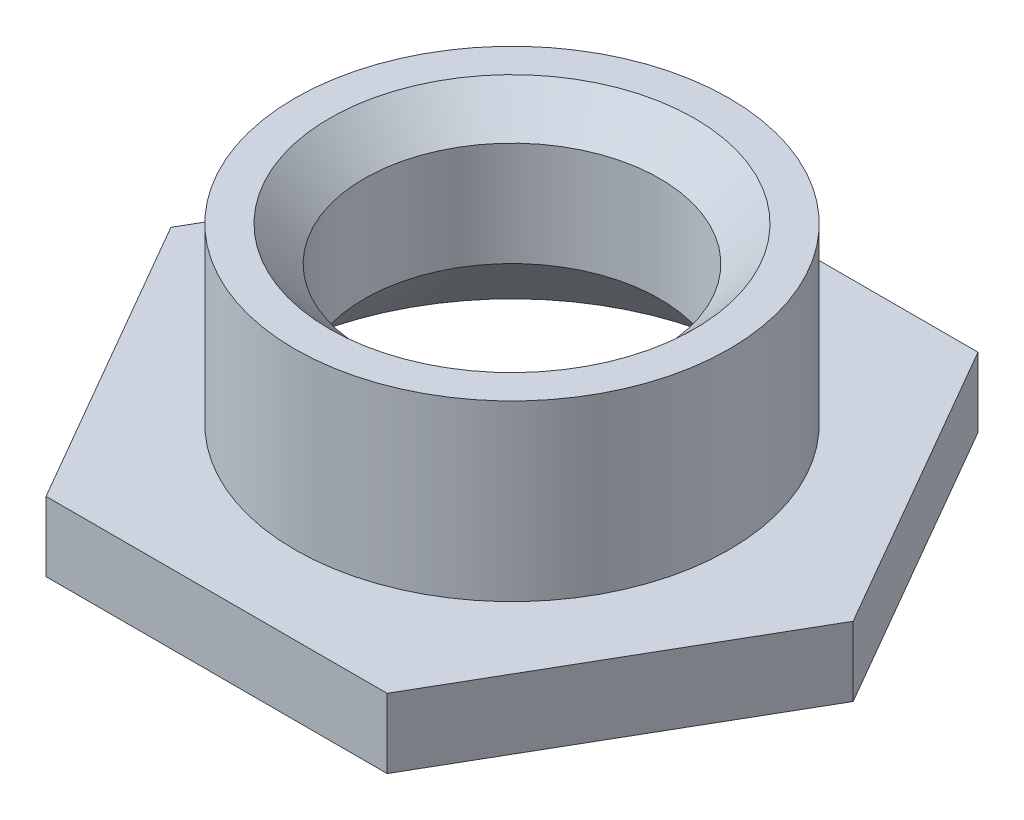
ISO-10303-21;
HEADER;
FILE_DESCRIPTION(('STEP AP214'),'2;1');
FILE_NAME('part.step','',(''),(''),'','','');
FILE_SCHEMA(('AUTOMOTIVE_DESIGN { 1 0 10303 214 1 1 1 1 }'));
ENDSEC;
DATA;
#1=APPLICATION_CONTEXT('core data for automotive mechanical design processes');
#2=APPLICATION_PROTOCOL_DEFINITION('international standard','automotive_design',2000,#1);
#3=PRODUCT_CONTEXT('',#1,'mechanical');
#4=PRODUCT('Part','Part','',(#3));
#5=PRODUCT_RELATED_PRODUCT_CATEGORY('part','',(#4));
#6=PRODUCT_DEFINITION_FORMATION('','',#4);
#7=PRODUCT_DEFINITION_CONTEXT('part definition',#1,'design');
#8=PRODUCT_DEFINITION('design','',#6,#7);
#9=PRODUCT_DEFINITION_SHAPE('','',#8);
#10=(LENGTH_UNIT() NAMED_UNIT(*) SI_UNIT(.MILLI.,.METRE.));
#11=(NAMED_UNIT(*) PLANE_ANGLE_UNIT() SI_UNIT($,.RADIAN.));
#12=(NAMED_UNIT(*) SI_UNIT($,.STERADIAN.) SOLID_ANGLE_UNIT());
#13=UNCERTAINTY_MEASURE_WITH_UNIT(LENGTH_MEASURE(1.E-05),#10,'distance_accuracy_value','');
#14=(GEOMETRIC_REPRESENTATION_CONTEXT(3) GLOBAL_UNCERTAINTY_ASSIGNED_CONTEXT((#13)) GLOBAL_UNIT_ASSIGNED_CONTEXT((#10,
#11,#12)) REPRESENTATION_CONTEXT('',''));
#15=CARTESIAN_POINT('',(0.,0.,0.));
#16=DIRECTION('',(0.,0.,1.));
#17=DIRECTION('',(1.,0.,0.));
#18=AXIS2_PLACEMENT_3D('',#15,#16,#17);
#19=CARTESIAN_POINT('',(4.90747728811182,2.,8.5));
#20=DIRECTION('',(-0.866025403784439,0.,-0.5));
#21=DIRECTION('',(-0.5,0.,0.866025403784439));
#22=AXIS2_PLACEMENT_3D('',#19,#20,#21);
#23=PLANE('',#22);
#24=DIRECTION('',(0.5,0.,-0.866025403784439));
#25=VECTOR('',#24,1.);
#26=CARTESIAN_POINT('',(4.90747728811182,0.,8.5));
#27=LINE('',#26,#25);
#28=CARTESIAN_POINT('',(4.90747728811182,0.,8.5));
#29=VERTEX_POINT('',#28);
#30=CARTESIAN_POINT('',(9.81495457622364,0.,0.));
#31=VERTEX_POINT('',#30);
#32=EDGE_CURVE('E130',#29,#31,#27,.T.);
#33=ORIENTED_EDGE('',*,*,#32,.T.);
#34=DIRECTION('',(0.,-1.,0.));
#35=VECTOR('',#34,1.);
#36=CARTESIAN_POINT('',(9.81495457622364,2.,0.));
#37=LINE('',#36,#35);
#38=CARTESIAN_POINT('',(9.81495457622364,2.,0.));
#39=VERTEX_POINT('',#38);
#40=EDGE_CURVE('E158',#39,#31,#37,.T.);
#41=ORIENTED_EDGE('',*,*,#40,.F.);
#42=DIRECTION('',(0.5,0.,-0.866025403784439));
#43=VECTOR('',#42,1.);
#44=CARTESIAN_POINT('',(4.90747728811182,2.,8.5));
#45=LINE('',#44,#43);
#46=CARTESIAN_POINT('',(4.90747728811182,2.,8.5));
#47=VERTEX_POINT('',#46);
#48=EDGE_CURVE('E147',#47,#39,#45,.T.);
#49=ORIENTED_EDGE('',*,*,#48,.F.);
#50=DIRECTION('',(0.,-1.,0.));
#51=VECTOR('',#50,1.);
#52=CARTESIAN_POINT('',(4.90747728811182,2.,8.5));
#53=LINE('',#52,#51);
#54=EDGE_CURVE('E126',#47,#29,#53,.T.);
#55=ORIENTED_EDGE('',*,*,#54,.T.);
#56=EDGE_LOOP('',(#33,#41,#49,#55));
#57=FACE_BOUND('',#56,.T.);
#58=ADVANCED_FACE('F39',(#57),#23,.F.);
#59=CARTESIAN_POINT('',(9.81495457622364,2.,0.));
#60=DIRECTION('',(-0.866025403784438,0.,0.5));
#61=DIRECTION('',(0.5,0.,0.866025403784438));
#62=AXIS2_PLACEMENT_3D('',#59,#60,#61);
#63=PLANE('',#62);
#64=DIRECTION('',(-0.5,0.,-0.866025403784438));
#65=VECTOR('',#64,1.);
#66=CARTESIAN_POINT('',(9.81495457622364,0.,0.));
#67=LINE('',#66,#65);
#68=CARTESIAN_POINT('',(4.90747728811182,0.,-8.5));
#69=VERTEX_POINT('',#68);
#70=EDGE_CURVE('E134',#31,#69,#67,.T.);
#71=ORIENTED_EDGE('',*,*,#70,.T.);
#72=DIRECTION('',(0.,-1.,0.));
#73=VECTOR('',#72,1.);
#74=CARTESIAN_POINT('',(4.90747728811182,2.,-8.5));
#75=LINE('',#74,#73);
#76=CARTESIAN_POINT('',(4.90747728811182,2.,-8.5));
#77=VERTEX_POINT('',#76);
#78=EDGE_CURVE('E154',#77,#69,#75,.T.);
#79=ORIENTED_EDGE('',*,*,#78,.F.);
#80=DIRECTION('',(-0.5,0.,-0.866025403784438));
#81=VECTOR('',#80,1.);
#82=CARTESIAN_POINT('',(9.81495457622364,2.,0.));
#83=LINE('',#82,#81);
#84=EDGE_CURVE('E95',#39,#77,#83,.T.);
#85=ORIENTED_EDGE('',*,*,#84,.F.);
#86=ORIENTED_EDGE('',*,*,#40,.T.);
#87=EDGE_LOOP('',(#71,#79,#85,#86));
#88=FACE_BOUND('',#87,.T.);
#89=ADVANCED_FACE('F186',(#88),#63,.F.);
#90=CARTESIAN_POINT('',(4.90747728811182,2.,-8.5));
#91=DIRECTION('',(0.,0.,1.));
#92=DIRECTION('',(1.,0.,0.));
#93=AXIS2_PLACEMENT_3D('',#90,#91,#92);
#94=PLANE('',#93);
#95=DIRECTION('',(-1.,0.,0.));
#96=VECTOR('',#95,1.);
#97=CARTESIAN_POINT('',(4.90747728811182,0.,-8.5));
#98=LINE('',#97,#96);
#99=CARTESIAN_POINT('',(-4.90747728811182,0.,-8.5));
#100=VERTEX_POINT('',#99);
#101=EDGE_CURVE('E138',#69,#100,#98,.T.);
#102=ORIENTED_EDGE('',*,*,#101,.T.);
#103=DIRECTION('',(0.,-1.,0.));
#104=VECTOR('',#103,1.);
#105=CARTESIAN_POINT('',(-4.90747728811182,2.,-8.5));
#106=LINE('',#105,#104);
#107=CARTESIAN_POINT('',(-4.90747728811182,2.,-8.5));
#108=VERTEX_POINT('',#107);
#109=EDGE_CURVE('E119',#108,#100,#106,.T.);
#110=ORIENTED_EDGE('',*,*,#109,.F.);
#111=DIRECTION('',(-1.,0.,0.));
#112=VECTOR('',#111,1.);
#113=CARTESIAN_POINT('',(4.90747728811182,2.,-8.5));
#114=LINE('',#113,#112);
#115=EDGE_CURVE('E108',#77,#108,#114,.T.);
#116=ORIENTED_EDGE('',*,*,#115,.F.);
#117=ORIENTED_EDGE('',*,*,#78,.T.);
#118=EDGE_LOOP('',(#102,#110,#116,#117));
#119=FACE_BOUND('',#118,.T.);
#120=ADVANCED_FACE('F192',(#119),#94,.F.);
#121=CARTESIAN_POINT('',(-4.90747728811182,2.,-8.5));
#122=DIRECTION('',(0.866025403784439,0.,0.5));
#123=DIRECTION('',(0.5,0.,-0.866025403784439));
#124=AXIS2_PLACEMENT_3D('',#121,#122,#123);
#125=PLANE('',#124);
#126=DIRECTION('',(-0.5,0.,0.866025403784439));
#127=VECTOR('',#126,1.);
#128=CARTESIAN_POINT('',(-4.90747728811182,0.,-8.5));
#129=LINE('',#128,#127);
#130=CARTESIAN_POINT('',(-9.81495457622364,0.,0.));
#131=VERTEX_POINT('',#130);
#132=EDGE_CURVE('E117',#100,#131,#129,.T.);
#133=ORIENTED_EDGE('',*,*,#132,.T.);
#134=DIRECTION('',(0.,-1.,0.));
#135=VECTOR('',#134,1.);
#136=CARTESIAN_POINT('',(-9.81495457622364,2.,0.));
#137=LINE('',#136,#135);
#138=CARTESIAN_POINT('',(-9.81495457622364,2.,0.));
#139=VERTEX_POINT('',#138);
#140=EDGE_CURVE('E114',#139,#131,#137,.T.);
#141=ORIENTED_EDGE('',*,*,#140,.F.);
#142=DIRECTION('',(-0.5,0.,0.866025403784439));
#143=VECTOR('',#142,1.);
#144=CARTESIAN_POINT('',(-4.90747728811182,2.,-8.5));
#145=LINE('',#144,#143);
#146=EDGE_CURVE('E102',#108,#139,#145,.T.);
#147=ORIENTED_EDGE('',*,*,#146,.F.);
#148=ORIENTED_EDGE('',*,*,#109,.T.);
#149=EDGE_LOOP('',(#133,#141,#147,#148));
#150=FACE_BOUND('',#149,.T.);
#151=ADVANCED_FACE('F115',(#150),#125,.F.);
#152=CARTESIAN_POINT('',(-9.81495457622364,2.,0.));
#153=DIRECTION('',(0.866025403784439,0.,-0.5));
#154=DIRECTION('',(-0.5,0.,-0.866025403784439));
#155=AXIS2_PLACEMENT_3D('',#152,#153,#154);
#156=PLANE('',#155);
#157=DIRECTION('',(0.5,0.,0.866025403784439));
#158=VECTOR('',#157,1.);
#159=CARTESIAN_POINT('',(-9.81495457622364,0.,0.));
#160=LINE('',#159,#158);
#161=CARTESIAN_POINT('',(-4.90747728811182,0.,8.5));
#162=VERTEX_POINT('',#161);
#163=EDGE_CURVE('E80',#131,#162,#160,.T.);
#164=ORIENTED_EDGE('',*,*,#163,.T.);
#165=DIRECTION('',(0.,-1.,0.));
#166=VECTOR('',#165,1.);
#167=CARTESIAN_POINT('',(-4.90747728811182,2.,8.5));
#168=LINE('',#167,#166);
#169=CARTESIAN_POINT('',(-4.90747728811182,2.,8.5));
#170=VERTEX_POINT('',#169);
#171=EDGE_CURVE('E120',#170,#162,#168,.T.);
#172=ORIENTED_EDGE('',*,*,#171,.F.);
#173=DIRECTION('',(0.5,0.,0.866025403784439));
#174=VECTOR('',#173,1.);
#175=CARTESIAN_POINT('',(-9.81495457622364,2.,0.));
#176=LINE('',#175,#174);
#177=EDGE_CURVE('E106',#139,#170,#176,.T.);
#178=ORIENTED_EDGE('',*,*,#177,.F.);
#179=ORIENTED_EDGE('',*,*,#140,.T.);
#180=EDGE_LOOP('',(#164,#172,#178,#179));
#181=FACE_BOUND('',#180,.T.);
#182=ADVANCED_FACE('F122',(#181),#156,.F.);
#183=CARTESIAN_POINT('',(-4.90747728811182,2.,8.5));
#184=DIRECTION('',(0.,0.,-1.));
#185=DIRECTION('',(-1.,0.,0.));
#186=AXIS2_PLACEMENT_3D('',#183,#184,#185);
#187=PLANE('',#186);
#188=DIRECTION('',(1.,0.,0.));
#189=VECTOR('',#188,1.);
#190=CARTESIAN_POINT('',(-4.90747728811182,0.,8.5));
#191=LINE('',#190,#189);
#192=EDGE_CURVE('E86',#162,#29,#191,.T.);
#193=ORIENTED_EDGE('',*,*,#192,.T.);
#194=ORIENTED_EDGE('',*,*,#54,.F.);
#195=DIRECTION('',(1.,0.,0.));
#196=VECTOR('',#195,1.);
#197=CARTESIAN_POINT('',(-4.90747728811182,2.,8.5));
#198=LINE('',#197,#196);
#199=EDGE_CURVE('E57',#170,#47,#198,.T.);
#200=ORIENTED_EDGE('',*,*,#199,.F.);
#201=ORIENTED_EDGE('',*,*,#171,.T.);
#202=EDGE_LOOP('',(#193,#194,#200,#201));
#203=FACE_BOUND('',#202,.T.);
#204=ADVANCED_FACE('F202',(#203),#187,.F.);
#205=CARTESIAN_POINT('',(0.,2.,0.));
#206=DIRECTION('',(0.,1.,0.));
#207=DIRECTION('',(0.,0.,1.));
#208=AXIS2_PLACEMENT_3D('',#205,#206,#207);
#209=PLANE('',#208);
#210=CARTESIAN_POINT('',(0.,2.,0.));
#211=DIRECTION('',(0.,1.,0.));
#212=DIRECTION('',(0.,0.,1.));
#213=AXIS2_PLACEMENT_3D('',#210,#211,#212);
#214=CIRCLE('',#213,6.25);
#215=CARTESIAN_POINT('',(0.,2.,6.25));
#216=VERTEX_POINT('',#215);
#217=EDGE_CURVE('E161',#216,#216,#214,.T.);
#218=ORIENTED_EDGE('',*,*,#217,.F.);
#219=EDGE_LOOP('',(#218));
#220=FACE_BOUND('',#219,.T.);
#221=ORIENTED_EDGE('',*,*,#48,.T.);
#222=ORIENTED_EDGE('',*,*,#84,.T.);
#223=ORIENTED_EDGE('',*,*,#115,.T.);
#224=ORIENTED_EDGE('',*,*,#146,.T.);
#225=ORIENTED_EDGE('',*,*,#177,.T.);
#226=ORIENTED_EDGE('',*,*,#199,.T.);
#227=EDGE_LOOP('',(#221,#222,#223,#224,#225,#226));
#228=FACE_BOUND('',#227,.T.);
#229=ADVANCED_FACE('F104',(#220,#228),#209,.T.);
#230=CARTESIAN_POINT('',(0.,0.,0.));
#231=DIRECTION('',(0.,1.,0.));
#232=DIRECTION('',(0.,0.,1.));
#233=AXIS2_PLACEMENT_3D('',#230,#231,#232);
#234=PLANE('',#233);
#235=CARTESIAN_POINT('',(0.,0.,0.));
#236=DIRECTION('',(0.,1.,0.));
#237=DIRECTION('',(0.,0.,1.));
#238=AXIS2_PLACEMENT_3D('',#235,#236,#237);
#239=CIRCLE('',#238,7.25);
#240=CARTESIAN_POINT('',(0.,0.,7.25));
#241=VERTEX_POINT('',#240);
#242=EDGE_CURVE('E49',#241,#241,#239,.T.);
#243=ORIENTED_EDGE('',*,*,#242,.T.);
#244=EDGE_LOOP('',(#243));
#245=FACE_BOUND('',#244,.T.);
#246=ORIENTED_EDGE('',*,*,#32,.F.);
#247=ORIENTED_EDGE('',*,*,#192,.F.);
#248=ORIENTED_EDGE('',*,*,#163,.F.);
#249=ORIENTED_EDGE('',*,*,#132,.F.);
#250=ORIENTED_EDGE('',*,*,#101,.F.);
#251=ORIENTED_EDGE('',*,*,#70,.F.);
#252=EDGE_LOOP('',(#246,#247,#248,#249,#250,#251));
#253=FACE_BOUND('',#252,.T.);
#254=ADVANCED_FACE('F173',(#245,#253),#234,.F.);
#255=CARTESIAN_POINT('',(0.,7.,0.));
#256=DIRECTION('',(0.,-1.,0.));
#257=DIRECTION('',(0.,0.,-1.));
#258=AXIS2_PLACEMENT_3D('',#255,#256,#257);
#259=CYLINDRICAL_SURFACE('',#258,6.25);
#260=CARTESIAN_POINT('',(0.,7.,0.));
#261=DIRECTION('',(0.,1.,0.));
#262=DIRECTION('',(0.,0.,1.));
#263=AXIS2_PLACEMENT_3D('',#260,#261,#262);
#264=CIRCLE('',#263,6.25);
#265=CARTESIAN_POINT('',(0.,7.,6.25));
#266=VERTEX_POINT('',#265);
#267=EDGE_CURVE('E135',#266,#266,#264,.T.);
#268=ORIENTED_EDGE('',*,*,#267,.F.);
#269=EDGE_LOOP('',(#268));
#270=FACE_BOUND('',#269,.T.);
#271=ORIENTED_EDGE('',*,*,#217,.T.);
#272=EDGE_LOOP('',(#271));
#273=FACE_BOUND('',#272,.T.);
#274=ADVANCED_FACE('F207',(#270,#273),#259,.T.);
#275=CARTESIAN_POINT('',(0.,7.,0.));
#276=DIRECTION('',(0.,1.,0.));
#277=DIRECTION('',(0.,0.,1.));
#278=AXIS2_PLACEMENT_3D('',#275,#276,#277);
#279=PLANE('',#278);
#280=CARTESIAN_POINT('',(0.,7.,0.));
#281=DIRECTION('',(0.,1.,0.));
#282=DIRECTION('',(0.,0.,1.));
#283=AXIS2_PLACEMENT_3D('',#280,#281,#282);
#284=CIRCLE('',#283,5.25000000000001);
#285=CARTESIAN_POINT('',(0.,7.,5.25000000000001));
#286=VERTEX_POINT('',#285);
#287=EDGE_CURVE('E166',#286,#286,#284,.F.);
#288=ORIENTED_EDGE('',*,*,#287,.T.);
#289=EDGE_LOOP('',(#288));
#290=FACE_BOUND('',#289,.T.);
#291=ORIENTED_EDGE('',*,*,#267,.T.);
#292=EDGE_LOOP('',(#291));
#293=FACE_BOUND('',#292,.T.);
#294=ADVANCED_FACE('F213',(#290,#293),#279,.T.);
#295=CARTESIAN_POINT('',(0.,0.,0.));
#296=DIRECTION('',(0.,1.,0.));
#297=DIRECTION('',(0.,0.,1.));
#298=AXIS2_PLACEMENT_3D('',#295,#296,#297);
#299=CYLINDRICAL_SURFACE('',#298,4.25);
#300=CARTESIAN_POINT('',(0.,3.00000000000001,0.));
#301=DIRECTION('',(0.,1.,0.));
#302=DIRECTION('',(0.,0.,1.));
#303=AXIS2_PLACEMENT_3D('',#300,#301,#302);
#304=CIRCLE('',#303,4.25);
#305=CARTESIAN_POINT('',(0.,3.00000000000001,4.25));
#306=VERTEX_POINT('',#305);
#307=EDGE_CURVE('E11',#306,#306,#304,.F.);
#308=ORIENTED_EDGE('',*,*,#307,.T.);
#309=EDGE_LOOP('',(#308));
#310=FACE_BOUND('',#309,.T.);
#311=CARTESIAN_POINT('',(0.,5.99999999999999,0.));
#312=DIRECTION('',(0.,1.,0.));
#313=DIRECTION('',(0.,0.,1.));
#314=AXIS2_PLACEMENT_3D('',#311,#312,#313);
#315=CIRCLE('',#314,4.25);
#316=CARTESIAN_POINT('',(0.,5.99999999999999,4.25));
#317=VERTEX_POINT('',#316);
#318=EDGE_CURVE('E162',#317,#317,#315,.T.);
#319=ORIENTED_EDGE('',*,*,#318,.T.);
#320=EDGE_LOOP('',(#319));
#321=FACE_BOUND('',#320,.T.);
#322=ADVANCED_FACE('F182',(#310,#321),#299,.F.);
#323=CARTESIAN_POINT('',(0.,5.99999999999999,0.));
#324=DIRECTION('',(0.,1.,0.));
#325=DIRECTION('',(0.,0.,1.));
#326=AXIS2_PLACEMENT_3D('',#323,#324,#325);
#327=CONICAL_SURFACE('',#326,4.25,0.785398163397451);
#328=ORIENTED_EDGE('',*,*,#287,.F.);
#329=EDGE_LOOP('',(#328));
#330=FACE_BOUND('',#329,.T.);
#331=ORIENTED_EDGE('',*,*,#318,.F.);
#332=EDGE_LOOP('',(#331));
#333=FACE_BOUND('',#332,.T.);
#334=ADVANCED_FACE('F177',(#330,#333),#327,.F.);
#335=CARTESIAN_POINT('',(0.,0.,0.));
#336=DIRECTION('',(0.,-1.,0.));
#337=DIRECTION('',(0.,0.,-1.));
#338=AXIS2_PLACEMENT_3D('',#335,#336,#337);
#339=CONICAL_SURFACE('',#338,7.25,0.785398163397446);
#340=ORIENTED_EDGE('',*,*,#307,.F.);
#341=EDGE_LOOP('',(#340));
#342=FACE_BOUND('',#341,.T.);
#343=ORIENTED_EDGE('',*,*,#242,.F.);
#344=EDGE_LOOP('',(#343));
#345=FACE_BOUND('',#344,.T.);
#346=ADVANCED_FACE('F41',(#342,#345),#339,.F.);
#347=CLOSED_SHELL('',(#58,#89,#120,#151,#182,#204,#229,#254,#274,#294,#322,#334,#346));
#348=MANIFOLD_SOLID_BREP('B2',#347);
#349=ADVANCED_BREP_SHAPE_REPRESENTATION('',(#18,#348),#14);
#350=SHAPE_DEFINITION_REPRESENTATION(#9,#349);
ENDSEC;
END-ISO-10303-21;
